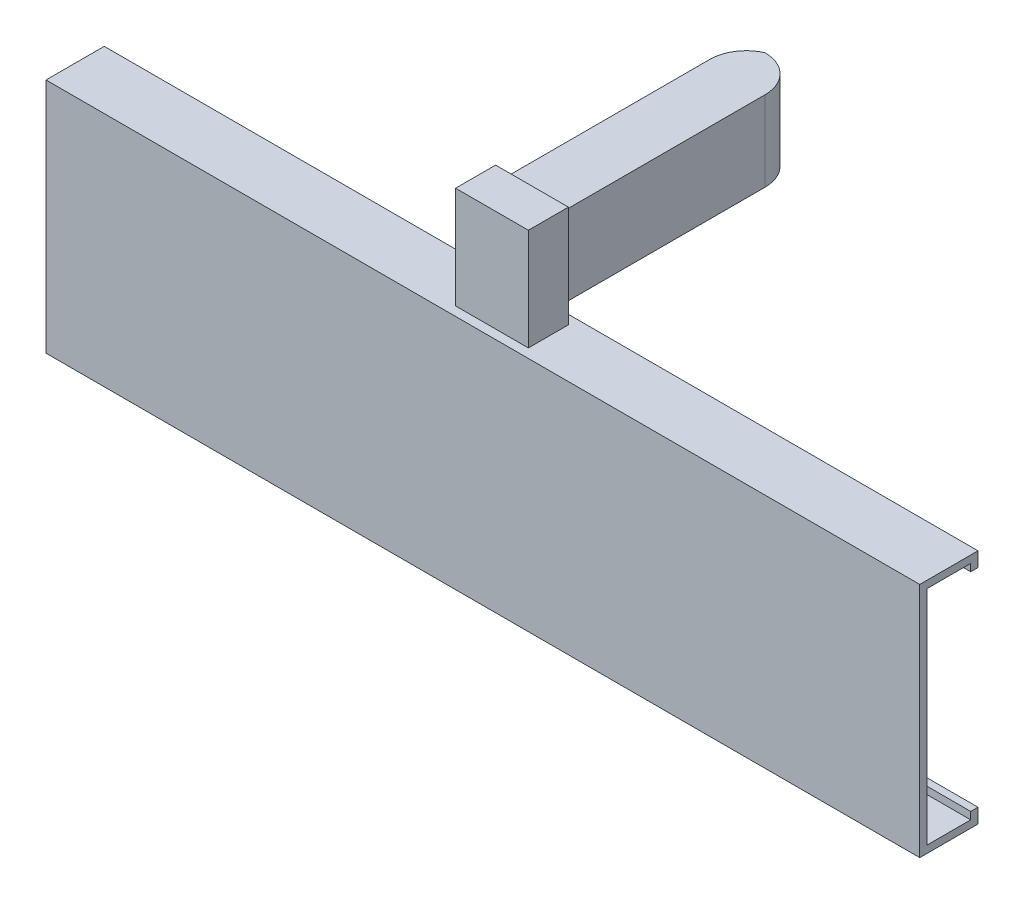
ISO-10303-21;
HEADER;
FILE_DESCRIPTION(('STEP AP214'),'2;1');
FILE_NAME('part.step','',(''),(''),'','','');
FILE_SCHEMA(('AUTOMOTIVE_DESIGN { 1 0 10303 214 1 1 1 1 }'));
ENDSEC;
DATA;
#1=APPLICATION_CONTEXT('core data for automotive mechanical design processes');
#2=APPLICATION_PROTOCOL_DEFINITION('international standard','automotive_design',2000,#1);
#3=PRODUCT_CONTEXT('',#1,'mechanical');
#4=PRODUCT('Part','Part','',(#3));
#5=PRODUCT_RELATED_PRODUCT_CATEGORY('part','',(#4));
#6=PRODUCT_DEFINITION_FORMATION('','',#4);
#7=PRODUCT_DEFINITION_CONTEXT('part definition',#1,'design');
#8=PRODUCT_DEFINITION('design','',#6,#7);
#9=PRODUCT_DEFINITION_SHAPE('','',#8);
#10=(LENGTH_UNIT() NAMED_UNIT(*) SI_UNIT(.MILLI.,.METRE.));
#11=(NAMED_UNIT(*) PLANE_ANGLE_UNIT() SI_UNIT($,.RADIAN.));
#12=(NAMED_UNIT(*) SI_UNIT($,.STERADIAN.) SOLID_ANGLE_UNIT());
#13=UNCERTAINTY_MEASURE_WITH_UNIT(LENGTH_MEASURE(1.E-05),#10,'distance_accuracy_value','');
#14=(GEOMETRIC_REPRESENTATION_CONTEXT(3) GLOBAL_UNCERTAINTY_ASSIGNED_CONTEXT((#13)) GLOBAL_UNIT_ASSIGNED_CONTEXT((#10,
#11,#12)) REPRESENTATION_CONTEXT('',''));
#15=CARTESIAN_POINT('',(0.,0.,0.));
#16=DIRECTION('',(0.,0.,1.));
#17=DIRECTION('',(1.,0.,0.));
#18=AXIS2_PLACEMENT_3D('',#15,#16,#17);
#19=CARTESIAN_POINT('',(-5.00108484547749,29.75,-5.75));
#20=DIRECTION('',(0.,0.,1.));
#21=DIRECTION('',(1.,0.,0.));
#22=AXIS2_PLACEMENT_3D('',#19,#20,#21);
#23=PLANE('',#22);
#24=DIRECTION('',(-1.,0.,0.));
#25=VECTOR('',#24,1.);
#26=CARTESIAN_POINT('',(-5.00108484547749,15.75,-5.75));
#27=LINE('',#26,#25);
#28=CARTESIAN_POINT('',(4.99891515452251,15.75,-5.75));
#29=VERTEX_POINT('',#28);
#30=CARTESIAN_POINT('',(-5.00108484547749,15.75,-5.75));
#31=VERTEX_POINT('',#30);
#32=EDGE_CURVE('E222',#29,#31,#27,.T.);
#33=ORIENTED_EDGE('',*,*,#32,.T.);
#34=DIRECTION('',(0.,-1.,0.));
#35=VECTOR('',#34,1.);
#36=CARTESIAN_POINT('',(-5.00108484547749,29.75,-5.75));
#37=LINE('',#36,#35);
#38=CARTESIAN_POINT('',(-5.00108484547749,29.75,-5.75));
#39=VERTEX_POINT('',#38);
#40=EDGE_CURVE('E235',#39,#31,#37,.T.);
#41=ORIENTED_EDGE('',*,*,#40,.F.);
#42=DIRECTION('',(-1.,0.,0.));
#43=VECTOR('',#42,1.);
#44=CARTESIAN_POINT('',(-5.00108484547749,29.75,-5.75));
#45=LINE('',#44,#43);
#46=CARTESIAN_POINT('',(4.99891515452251,29.75,-5.75));
#47=VERTEX_POINT('',#46);
#48=EDGE_CURVE('E212',#47,#39,#45,.T.);
#49=ORIENTED_EDGE('',*,*,#48,.F.);
#50=DIRECTION('',(0.,-1.,0.));
#51=VECTOR('',#50,1.);
#52=CARTESIAN_POINT('',(4.99891515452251,29.75,-5.75));
#53=LINE('',#52,#51);
#54=EDGE_CURVE('E238',#47,#29,#53,.T.);
#55=ORIENTED_EDGE('',*,*,#54,.T.);
#56=EDGE_LOOP('',(#33,#41,#49,#55));
#57=FACE_BOUND('',#56,.T.);
#58=DIRECTION('',(0.,1.,0.));
#59=VECTOR('',#58,1.);
#60=CARTESIAN_POINT('',(-4.00108484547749,17.6137453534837,-5.75));
#61=LINE('',#60,#59);
#62=CARTESIAN_POINT('',(-4.00108484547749,17.6137453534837,-5.75));
#63=VERTEX_POINT('',#62);
#64=CARTESIAN_POINT('',(-4.00108484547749,28.6137453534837,-5.75));
#65=VERTEX_POINT('',#64);
#66=EDGE_CURVE('E181',#63,#65,#61,.T.);
#67=ORIENTED_EDGE('',*,*,#66,.F.);
#68=DIRECTION('',(-1.,0.,0.));
#69=VECTOR('',#68,1.);
#70=CARTESIAN_POINT('',(3.99891515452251,17.6137453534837,-5.75));
#71=LINE('',#70,#69);
#72=CARTESIAN_POINT('',(3.99891515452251,17.6137453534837,-5.75));
#73=VERTEX_POINT('',#72);
#74=EDGE_CURVE('E186',#73,#63,#71,.T.);
#75=ORIENTED_EDGE('',*,*,#74,.F.);
#76=DIRECTION('',(0.,-1.,0.));
#77=VECTOR('',#76,1.);
#78=CARTESIAN_POINT('',(3.99891515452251,17.6137453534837,-5.75));
#79=LINE('',#78,#77);
#80=CARTESIAN_POINT('',(3.99891515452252,28.6137453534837,-5.75));
#81=VERTEX_POINT('',#80);
#82=EDGE_CURVE('E198',#81,#73,#79,.T.);
#83=ORIENTED_EDGE('',*,*,#82,.F.);
#84=DIRECTION('',(1.,0.,0.));
#85=VECTOR('',#84,1.);
#86=CARTESIAN_POINT('',(3.99891515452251,28.6137453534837,-5.75));
#87=LINE('',#86,#85);
#88=EDGE_CURVE('E194',#65,#81,#87,.T.);
#89=ORIENTED_EDGE('',*,*,#88,.F.);
#90=EDGE_LOOP('',(#67,#75,#83,#89));
#91=FACE_BOUND('',#90,.T.);
#92=ADVANCED_FACE('F39',(#57,#91),#23,.F.);
#93=CARTESIAN_POINT('',(-60.,15.75,1.));
#94=DIRECTION('',(0.,-1.,0.));
#95=DIRECTION('',(0.,0.,-1.));
#96=AXIS2_PLACEMENT_3D('',#93,#94,#95);
#97=PLANE('',#96);
#98=DIRECTION('',(0.,0.,-1.));
#99=VECTOR('',#98,1.);
#100=CARTESIAN_POINT('',(60.,15.75,1.));
#101=LINE('',#100,#99);
#102=CARTESIAN_POINT('',(60.,15.75,1.));
#103=VERTEX_POINT('',#102);
#104=CARTESIAN_POINT('',(60.,15.75,-7.));
#105=VERTEX_POINT('',#104);
#106=EDGE_CURVE('E330',#103,#105,#101,.T.);
#107=ORIENTED_EDGE('',*,*,#106,.T.);
#108=DIRECTION('',(-1.,0.,0.));
#109=VECTOR('',#108,1.);
#110=CARTESIAN_POINT('',(-60.,15.75,-7.));
#111=LINE('',#110,#109);
#112=CARTESIAN_POINT('',(-60.,15.75,-7.));
#113=VERTEX_POINT('',#112);
#114=EDGE_CURVE('E296',#105,#113,#111,.T.);
#115=ORIENTED_EDGE('',*,*,#114,.T.);
#116=DIRECTION('',(0.,0.,-1.));
#117=VECTOR('',#116,1.);
#118=CARTESIAN_POINT('',(-60.,15.75,1.));
#119=LINE('',#118,#117);
#120=CARTESIAN_POINT('',(-60.,15.75,1.));
#121=VERTEX_POINT('',#120);
#122=EDGE_CURVE('E322',#121,#113,#119,.T.);
#123=ORIENTED_EDGE('',*,*,#122,.F.);
#124=DIRECTION('',(-1.,0.,0.));
#125=VECTOR('',#124,1.);
#126=CARTESIAN_POINT('',(-60.,15.75,1.));
#127=LINE('',#126,#125);
#128=EDGE_CURVE('E317',#103,#121,#127,.T.);
#129=ORIENTED_EDGE('',*,*,#128,.F.);
#130=EDGE_LOOP('',(#107,#115,#123,#129));
#131=FACE_BOUND('',#130,.T.);
#132=DIRECTION('',(0.,0.,-1.));
#133=VECTOR('',#132,1.);
#134=CARTESIAN_POINT('',(4.99891515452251,15.75,-5.75));
#135=LINE('',#134,#133);
#136=CARTESIAN_POINT('',(4.99891515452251,15.75,-0.250000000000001));
#137=VERTEX_POINT('',#136);
#138=EDGE_CURVE('E208',#137,#29,#135,.T.);
#139=ORIENTED_EDGE('',*,*,#138,.F.);
#140=DIRECTION('',(1.,0.,0.));
#141=VECTOR('',#140,1.);
#142=CARTESIAN_POINT('',(-5.00108484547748,15.75,-0.250000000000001));
#143=LINE('',#142,#141);
#144=CARTESIAN_POINT('',(-5.00108484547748,15.75,-0.250000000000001));
#145=VERTEX_POINT('',#144);
#146=EDGE_CURVE('E213',#145,#137,#143,.T.);
#147=ORIENTED_EDGE('',*,*,#146,.F.);
#148=DIRECTION('',(0.,0.,1.));
#149=VECTOR('',#148,1.);
#150=CARTESIAN_POINT('',(-5.00108484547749,15.75,-5.75));
#151=LINE('',#150,#149);
#152=EDGE_CURVE('E225',#31,#145,#151,.T.);
#153=ORIENTED_EDGE('',*,*,#152,.F.);
#154=ORIENTED_EDGE('',*,*,#32,.F.);
#155=EDGE_LOOP('',(#139,#147,#153,#154));
#156=FACE_BOUND('',#155,.T.);
#157=ADVANCED_FACE('F362',(#131,#156),#97,.F.);
#158=CARTESIAN_POINT('',(0.,-15.75,0.));
#159=DIRECTION('',(0.,-1.,0.));
#160=DIRECTION('',(0.,0.,-1.));
#161=AXIS2_PLACEMENT_3D('',#158,#159,#160);
#162=PLANE('',#161);
#163=DIRECTION('',(1.,0.,0.));
#164=VECTOR('',#163,1.);
#165=CARTESIAN_POINT('',(-60.,-15.75,-6.));
#166=LINE('',#165,#164);
#167=CARTESIAN_POINT('',(-60.,-15.75,-6.));
#168=VERTEX_POINT('',#167);
#169=CARTESIAN_POINT('',(60.,-15.75,-6.));
#170=VERTEX_POINT('',#169);
#171=EDGE_CURVE('E241',#168,#170,#166,.T.);
#172=ORIENTED_EDGE('',*,*,#171,.F.);
#173=DIRECTION('',(0.,0.,-1.));
#174=VECTOR('',#173,1.);
#175=CARTESIAN_POINT('',(-60.,-15.75,1.));
#176=LINE('',#175,#174);
#177=CARTESIAN_POINT('',(-60.,-15.75,0.));
#178=VERTEX_POINT('',#177);
#179=EDGE_CURVE('E259',#178,#168,#176,.T.);
#180=ORIENTED_EDGE('',*,*,#179,.F.);
#181=DIRECTION('',(1.,0.,0.));
#182=VECTOR('',#181,1.);
#183=CARTESIAN_POINT('',(-60.,-15.75,0.));
#184=LINE('',#183,#182);
#185=CARTESIAN_POINT('',(60.,-15.75,0.));
#186=VERTEX_POINT('',#185);
#187=EDGE_CURVE('E318',#178,#186,#184,.T.);
#188=ORIENTED_EDGE('',*,*,#187,.T.);
#189=DIRECTION('',(0.,0.,1.));
#190=VECTOR('',#189,1.);
#191=CARTESIAN_POINT('',(60.,-15.75,1.));
#192=LINE('',#191,#190);
#193=EDGE_CURVE('E264',#170,#186,#192,.T.);
#194=ORIENTED_EDGE('',*,*,#193,.F.);
#195=EDGE_LOOP('',(#172,#180,#188,#194));
#196=FACE_BOUND('',#195,.T.);
#197=ADVANCED_FACE('F369',(#196),#162,.F.);
#198=CARTESIAN_POINT('',(0.,14.75,0.));
#199=DIRECTION('',(0.,-1.,0.));
#200=DIRECTION('',(0.,0.,-1.));
#201=AXIS2_PLACEMENT_3D('',#198,#199,#200);
#202=PLANE('',#201);
#203=DIRECTION('',(0.,0.,1.));
#204=VECTOR('',#203,1.);
#205=CARTESIAN_POINT('',(-60.,14.75,0.));
#206=LINE('',#205,#204);
#207=CARTESIAN_POINT('',(-60.,14.75,-6.));
#208=VERTEX_POINT('',#207);
#209=CARTESIAN_POINT('',(-60.,14.75,0.));
#210=VERTEX_POINT('',#209);
#211=EDGE_CURVE('E297',#208,#210,#206,.T.);
#212=ORIENTED_EDGE('',*,*,#211,.F.);
#213=DIRECTION('',(-1.,0.,0.));
#214=VECTOR('',#213,1.);
#215=CARTESIAN_POINT('',(-60.,14.75,-6.));
#216=LINE('',#215,#214);
#217=CARTESIAN_POINT('',(60.,14.75,-6.));
#218=VERTEX_POINT('',#217);
#219=EDGE_CURVE('E279',#218,#208,#216,.T.);
#220=ORIENTED_EDGE('',*,*,#219,.F.);
#221=DIRECTION('',(0.,0.,-1.));
#222=VECTOR('',#221,1.);
#223=CARTESIAN_POINT('',(60.,14.75,0.));
#224=LINE('',#223,#222);
#225=CARTESIAN_POINT('',(60.,14.75,0.));
#226=VERTEX_POINT('',#225);
#227=EDGE_CURVE('E302',#226,#218,#224,.T.);
#228=ORIENTED_EDGE('',*,*,#227,.F.);
#229=DIRECTION('',(1.,0.,0.));
#230=VECTOR('',#229,1.);
#231=CARTESIAN_POINT('',(-60.,14.75,0.));
#232=LINE('',#231,#230);
#233=EDGE_CURVE('E299',#210,#226,#232,.T.);
#234=ORIENTED_EDGE('',*,*,#233,.F.);
#235=EDGE_LOOP('',(#212,#220,#228,#234));
#236=FACE_BOUND('',#235,.T.);
#237=ADVANCED_FACE('F395',(#236),#202,.T.);
#238=CARTESIAN_POINT('',(0.,0.,0.));
#239=DIRECTION('',(0.,0.,-1.));
#240=DIRECTION('',(-1.,0.,0.));
#241=AXIS2_PLACEMENT_3D('',#238,#239,#240);
#242=PLANE('',#241);
#243=DIRECTION('',(0.,-1.,0.));
#244=VECTOR('',#243,1.);
#245=CARTESIAN_POINT('',(-60.,-15.75,0.));
#246=LINE('',#245,#244);
#247=EDGE_CURVE('E325',#210,#178,#246,.T.);
#248=ORIENTED_EDGE('',*,*,#247,.F.);
#249=ORIENTED_EDGE('',*,*,#233,.T.);
#250=DIRECTION('',(0.,1.,0.));
#251=VECTOR('',#250,1.);
#252=CARTESIAN_POINT('',(60.,-15.75,0.));
#253=LINE('',#252,#251);
#254=EDGE_CURVE('E311',#186,#226,#253,.T.);
#255=ORIENTED_EDGE('',*,*,#254,.F.);
#256=ORIENTED_EDGE('',*,*,#187,.F.);
#257=EDGE_LOOP('',(#248,#249,#255,#256));
#258=FACE_BOUND('',#257,.T.);
#259=ADVANCED_FACE('F411',(#258),#242,.T.);
#260=CARTESIAN_POINT('',(60.,-15.75,1.));
#261=DIRECTION('',(-1.,0.,0.));
#262=DIRECTION('',(0.,0.,1.));
#263=AXIS2_PLACEMENT_3D('',#260,#261,#262);
#264=PLANE('',#263);
#265=ORIENTED_EDGE('',*,*,#254,.T.);
#266=ORIENTED_EDGE('',*,*,#227,.T.);
#267=DIRECTION('',(0.,1.,0.));
#268=VECTOR('',#267,1.);
#269=CARTESIAN_POINT('',(60.,13.75,-6.));
#270=LINE('',#269,#268);
#271=CARTESIAN_POINT('',(60.,13.75,-6.));
#272=VERTEX_POINT('',#271);
#273=EDGE_CURVE('E294',#272,#218,#270,.T.);
#274=ORIENTED_EDGE('',*,*,#273,.F.);
#275=DIRECTION('',(0.,0.,1.));
#276=VECTOR('',#275,1.);
#277=CARTESIAN_POINT('',(60.,13.75,-7.));
#278=LINE('',#277,#276);
#279=CARTESIAN_POINT('',(60.,13.75,-7.));
#280=VERTEX_POINT('',#279);
#281=EDGE_CURVE('E286',#280,#272,#278,.T.);
#282=ORIENTED_EDGE('',*,*,#281,.F.);
#283=DIRECTION('',(0.,1.,0.));
#284=VECTOR('',#283,1.);
#285=CARTESIAN_POINT('',(60.,14.75,-7.));
#286=LINE('',#285,#284);
#287=EDGE_CURVE('E305',#280,#105,#286,.T.);
#288=ORIENTED_EDGE('',*,*,#287,.T.);
#289=ORIENTED_EDGE('',*,*,#106,.F.);
#290=DIRECTION('',(0.,1.,0.));
#291=VECTOR('',#290,1.);
#292=CARTESIAN_POINT('',(60.,-15.75,1.));
#293=LINE('',#292,#291);
#294=CARTESIAN_POINT('',(60.,-16.75,1.));
#295=VERTEX_POINT('',#294);
#296=EDGE_CURVE('E314',#295,#103,#293,.T.);
#297=ORIENTED_EDGE('',*,*,#296,.F.);
#298=DIRECTION('',(0.,0.,1.));
#299=VECTOR('',#298,1.);
#300=CARTESIAN_POINT('',(60.,-16.75,1.));
#301=LINE('',#300,#299);
#302=CARTESIAN_POINT('',(60.,-16.75,-7.));
#303=VERTEX_POINT('',#302);
#304=EDGE_CURVE('E266',#303,#295,#301,.T.);
#305=ORIENTED_EDGE('',*,*,#304,.F.);
#306=DIRECTION('',(0.,1.,0.));
#307=VECTOR('',#306,1.);
#308=CARTESIAN_POINT('',(60.,-16.75,-7.));
#309=LINE('',#308,#307);
#310=CARTESIAN_POINT('',(60.,-14.75,-7.));
#311=VERTEX_POINT('',#310);
#312=EDGE_CURVE('E272',#303,#311,#309,.T.);
#313=ORIENTED_EDGE('',*,*,#312,.T.);
#314=DIRECTION('',(0.,0.,-1.));
#315=VECTOR('',#314,1.);
#316=CARTESIAN_POINT('',(60.,-14.75,-7.));
#317=LINE('',#316,#315);
#318=CARTESIAN_POINT('',(60.,-14.75,-6.));
#319=VERTEX_POINT('',#318);
#320=EDGE_CURVE('E247',#319,#311,#317,.T.);
#321=ORIENTED_EDGE('',*,*,#320,.F.);
#322=DIRECTION('',(0.,-1.,0.));
#323=VECTOR('',#322,1.);
#324=CARTESIAN_POINT('',(60.,-14.75,-6.));
#325=LINE('',#324,#323);
#326=EDGE_CURVE('E253',#319,#170,#325,.T.);
#327=ORIENTED_EDGE('',*,*,#326,.T.);
#328=ORIENTED_EDGE('',*,*,#193,.T.);
#329=EDGE_LOOP('',(#265,#266,#274,#282,#288,#289,#297,#305,#313,#321,#327,#328));
#330=FACE_BOUND('',#329,.T.);
#331=ADVANCED_FACE('F423',(#330),#264,.F.);
#332=CARTESIAN_POINT('',(-60.,-15.75,1.));
#333=DIRECTION('',(1.,0.,0.));
#334=DIRECTION('',(0.,0.,-1.));
#335=AXIS2_PLACEMENT_3D('',#332,#333,#334);
#336=PLANE('',#335);
#337=ORIENTED_EDGE('',*,*,#122,.T.);
#338=DIRECTION('',(0.,1.,0.));
#339=VECTOR('',#338,1.);
#340=CARTESIAN_POINT('',(-60.,14.75,-7.));
#341=LINE('',#340,#339);
#342=CARTESIAN_POINT('',(-60.,13.75,-7.));
#343=VERTEX_POINT('',#342);
#344=EDGE_CURVE('E308',#343,#113,#341,.T.);
#345=ORIENTED_EDGE('',*,*,#344,.F.);
#346=DIRECTION('',(0.,0.,-1.));
#347=VECTOR('',#346,1.);
#348=CARTESIAN_POINT('',(-60.,13.75,-7.));
#349=LINE('',#348,#347);
#350=CARTESIAN_POINT('',(-60.,13.75,-6.));
#351=VERTEX_POINT('',#350);
#352=EDGE_CURVE('E280',#351,#343,#349,.T.);
#353=ORIENTED_EDGE('',*,*,#352,.F.);
#354=DIRECTION('',(0.,1.,0.));
#355=VECTOR('',#354,1.);
#356=CARTESIAN_POINT('',(-60.,13.75,-6.));
#357=LINE('',#356,#355);
#358=EDGE_CURVE('E290',#351,#208,#357,.T.);
#359=ORIENTED_EDGE('',*,*,#358,.T.);
#360=ORIENTED_EDGE('',*,*,#211,.T.);
#361=ORIENTED_EDGE('',*,*,#247,.T.);
#362=ORIENTED_EDGE('',*,*,#179,.T.);
#363=DIRECTION('',(0.,-1.,0.));
#364=VECTOR('',#363,1.);
#365=CARTESIAN_POINT('',(-60.,-14.75,-6.));
#366=LINE('',#365,#364);
#367=CARTESIAN_POINT('',(-60.,-14.75,-6.));
#368=VERTEX_POINT('',#367);
#369=EDGE_CURVE('E257',#368,#168,#366,.T.);
#370=ORIENTED_EDGE('',*,*,#369,.F.);
#371=DIRECTION('',(0.,0.,1.));
#372=VECTOR('',#371,1.);
#373=CARTESIAN_POINT('',(-60.,-14.75,-7.));
#374=LINE('',#373,#372);
#375=CARTESIAN_POINT('',(-60.,-14.75,-7.));
#376=VERTEX_POINT('',#375);
#377=EDGE_CURVE('E242',#376,#368,#374,.T.);
#378=ORIENTED_EDGE('',*,*,#377,.F.);
#379=DIRECTION('',(0.,1.,0.));
#380=VECTOR('',#379,1.);
#381=CARTESIAN_POINT('',(-60.,-16.75,-7.));
#382=LINE('',#381,#380);
#383=CARTESIAN_POINT('',(-60.,-16.75,-7.));
#384=VERTEX_POINT('',#383);
#385=EDGE_CURVE('E277',#384,#376,#382,.T.);
#386=ORIENTED_EDGE('',*,*,#385,.F.);
#387=DIRECTION('',(0.,0.,-1.));
#388=VECTOR('',#387,1.);
#389=CARTESIAN_POINT('',(-60.,-16.75,1.));
#390=LINE('',#389,#388);
#391=CARTESIAN_POINT('',(-60.,-16.75,1.));
#392=VERTEX_POINT('',#391);
#393=EDGE_CURVE('E260',#392,#384,#390,.T.);
#394=ORIENTED_EDGE('',*,*,#393,.F.);
#395=DIRECTION('',(0.,-1.,0.));
#396=VECTOR('',#395,1.);
#397=CARTESIAN_POINT('',(-60.,-15.75,1.));
#398=LINE('',#397,#396);
#399=EDGE_CURVE('E320',#121,#392,#398,.T.);
#400=ORIENTED_EDGE('',*,*,#399,.F.);
#401=EDGE_LOOP('',(#337,#345,#353,#359,#360,#361,#362,#370,#378,#386,#394,#400));
#402=FACE_BOUND('',#401,.T.);
#403=ADVANCED_FACE('F419',(#402),#336,.F.);
#404=CARTESIAN_POINT('',(0.,0.,1.));
#405=DIRECTION('',(0.,0.,-1.));
#406=DIRECTION('',(-1.,0.,0.));
#407=AXIS2_PLACEMENT_3D('',#404,#405,#406);
#408=PLANE('',#407);
#409=ORIENTED_EDGE('',*,*,#296,.T.);
#410=ORIENTED_EDGE('',*,*,#128,.T.);
#411=ORIENTED_EDGE('',*,*,#399,.T.);
#412=DIRECTION('',(-1.,0.,0.));
#413=VECTOR('',#412,1.);
#414=CARTESIAN_POINT('',(-60.,-16.75,1.));
#415=LINE('',#414,#413);
#416=EDGE_CURVE('E269',#295,#392,#415,.T.);
#417=ORIENTED_EDGE('',*,*,#416,.F.);
#418=EDGE_LOOP('',(#409,#410,#411,#417));
#419=FACE_BOUND('',#418,.T.);
#420=ADVANCED_FACE('F415',(#419),#408,.F.);
#421=CARTESIAN_POINT('',(-60.,14.75,-7.));
#422=DIRECTION('',(0.,0.,-1.));
#423=DIRECTION('',(-1.,0.,0.));
#424=AXIS2_PLACEMENT_3D('',#421,#422,#423);
#425=PLANE('',#424);
#426=ORIENTED_EDGE('',*,*,#114,.F.);
#427=ORIENTED_EDGE('',*,*,#287,.F.);
#428=DIRECTION('',(1.,0.,0.));
#429=VECTOR('',#428,1.);
#430=CARTESIAN_POINT('',(-60.,13.75,-7.));
#431=LINE('',#430,#429);
#432=EDGE_CURVE('E283',#343,#280,#431,.T.);
#433=ORIENTED_EDGE('',*,*,#432,.F.);
#434=ORIENTED_EDGE('',*,*,#344,.T.);
#435=EDGE_LOOP('',(#426,#427,#433,#434));
#436=FACE_BOUND('',#435,.T.);
#437=ADVANCED_FACE('F407',(#436),#425,.T.);
#438=CARTESIAN_POINT('',(-60.,13.75,-6.));
#439=DIRECTION('',(0.,0.,-1.));
#440=DIRECTION('',(-1.,0.,0.));
#441=AXIS2_PLACEMENT_3D('',#438,#439,#440);
#442=PLANE('',#441);
#443=ORIENTED_EDGE('',*,*,#219,.T.);
#444=ORIENTED_EDGE('',*,*,#358,.F.);
#445=DIRECTION('',(-1.,0.,0.));
#446=VECTOR('',#445,1.);
#447=CARTESIAN_POINT('',(-60.,13.75,-6.));
#448=LINE('',#447,#446);
#449=EDGE_CURVE('E288',#272,#351,#448,.T.);
#450=ORIENTED_EDGE('',*,*,#449,.F.);
#451=ORIENTED_EDGE('',*,*,#273,.T.);
#452=EDGE_LOOP('',(#443,#444,#450,#451));
#453=FACE_BOUND('',#452,.T.);
#454=ADVANCED_FACE('F403',(#453),#442,.F.);
#455=CARTESIAN_POINT('',(0.,13.75,0.));
#456=DIRECTION('',(0.,1.,0.));
#457=DIRECTION('',(0.,0.,1.));
#458=AXIS2_PLACEMENT_3D('',#455,#456,#457);
#459=PLANE('',#458);
#460=ORIENTED_EDGE('',*,*,#352,.T.);
#461=ORIENTED_EDGE('',*,*,#432,.T.);
#462=ORIENTED_EDGE('',*,*,#281,.T.);
#463=ORIENTED_EDGE('',*,*,#449,.T.);
#464=EDGE_LOOP('',(#460,#461,#462,#463));
#465=FACE_BOUND('',#464,.T.);
#466=ADVANCED_FACE('F399',(#465),#459,.F.);
#467=CARTESIAN_POINT('',(-60.,-16.75,-7.));
#468=DIRECTION('',(0.,0.,1.));
#469=DIRECTION('',(1.,0.,0.));
#470=AXIS2_PLACEMENT_3D('',#467,#468,#469);
#471=PLANE('',#470);
#472=ORIENTED_EDGE('',*,*,#385,.T.);
#473=DIRECTION('',(-1.,0.,0.));
#474=VECTOR('',#473,1.);
#475=CARTESIAN_POINT('',(-60.,-14.75,-7.));
#476=LINE('',#475,#474);
#477=EDGE_CURVE('E250',#311,#376,#476,.T.);
#478=ORIENTED_EDGE('',*,*,#477,.F.);
#479=ORIENTED_EDGE('',*,*,#312,.F.);
#480=DIRECTION('',(1.,0.,0.));
#481=VECTOR('',#480,1.);
#482=CARTESIAN_POINT('',(-60.,-16.75,-7.));
#483=LINE('',#482,#481);
#484=EDGE_CURVE('E263',#384,#303,#483,.T.);
#485=ORIENTED_EDGE('',*,*,#484,.F.);
#486=EDGE_LOOP('',(#472,#478,#479,#485));
#487=FACE_BOUND('',#486,.T.);
#488=ADVANCED_FACE('F391',(#487),#471,.F.);
#489=CARTESIAN_POINT('',(0.,-16.75,0.));
#490=DIRECTION('',(0.,-1.,0.));
#491=DIRECTION('',(0.,0.,-1.));
#492=AXIS2_PLACEMENT_3D('',#489,#490,#491);
#493=PLANE('',#492);
#494=ORIENTED_EDGE('',*,*,#393,.T.);
#495=ORIENTED_EDGE('',*,*,#484,.T.);
#496=ORIENTED_EDGE('',*,*,#304,.T.);
#497=ORIENTED_EDGE('',*,*,#416,.T.);
#498=EDGE_LOOP('',(#494,#495,#496,#497));
#499=FACE_BOUND('',#498,.T.);
#500=ADVANCED_FACE('F387',(#499),#493,.T.);
#501=CARTESIAN_POINT('',(-60.,-14.75,-6.));
#502=DIRECTION('',(0.,0.,-1.));
#503=DIRECTION('',(-1.,0.,0.));
#504=AXIS2_PLACEMENT_3D('',#501,#502,#503);
#505=PLANE('',#504);
#506=ORIENTED_EDGE('',*,*,#171,.T.);
#507=ORIENTED_EDGE('',*,*,#326,.F.);
#508=DIRECTION('',(1.,0.,0.));
#509=VECTOR('',#508,1.);
#510=CARTESIAN_POINT('',(-60.,-14.75,-6.));
#511=LINE('',#510,#509);
#512=EDGE_CURVE('E245',#368,#319,#511,.T.);
#513=ORIENTED_EDGE('',*,*,#512,.F.);
#514=ORIENTED_EDGE('',*,*,#369,.T.);
#515=EDGE_LOOP('',(#506,#507,#513,#514));
#516=FACE_BOUND('',#515,.T.);
#517=ADVANCED_FACE('F383',(#516),#505,.F.);
#518=CARTESIAN_POINT('',(0.,-14.75,0.));
#519=DIRECTION('',(0.,1.,0.));
#520=DIRECTION('',(0.,0.,1.));
#521=AXIS2_PLACEMENT_3D('',#518,#519,#520);
#522=PLANE('',#521);
#523=ORIENTED_EDGE('',*,*,#377,.T.);
#524=ORIENTED_EDGE('',*,*,#512,.T.);
#525=ORIENTED_EDGE('',*,*,#320,.T.);
#526=ORIENTED_EDGE('',*,*,#477,.T.);
#527=EDGE_LOOP('',(#523,#524,#525,#526));
#528=FACE_BOUND('',#527,.T.);
#529=ADVANCED_FACE('F379',(#528),#522,.T.);
#530=CARTESIAN_POINT('',(4.99891515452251,29.75,-5.75));
#531=DIRECTION('',(-1.,0.,0.));
#532=DIRECTION('',(0.,0.,1.));
#533=AXIS2_PLACEMENT_3D('',#530,#531,#532);
#534=PLANE('',#533);
#535=ORIENTED_EDGE('',*,*,#138,.T.);
#536=ORIENTED_EDGE('',*,*,#54,.F.);
#537=DIRECTION('',(0.,0.,-1.));
#538=VECTOR('',#537,1.);
#539=CARTESIAN_POINT('',(4.99891515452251,29.75,-5.75));
#540=LINE('',#539,#538);
#541=CARTESIAN_POINT('',(4.99891515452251,29.75,-0.250000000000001));
#542=VERTEX_POINT('',#541);
#543=EDGE_CURVE('E209',#542,#47,#540,.T.);
#544=ORIENTED_EDGE('',*,*,#543,.F.);
#545=DIRECTION('',(0.,-1.,0.));
#546=VECTOR('',#545,1.);
#547=CARTESIAN_POINT('',(4.99891515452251,29.75,-0.250000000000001));
#548=LINE('',#547,#546);
#549=EDGE_CURVE('E219',#542,#137,#548,.T.);
#550=ORIENTED_EDGE('',*,*,#549,.T.);
#551=EDGE_LOOP('',(#535,#536,#544,#550));
#552=FACE_BOUND('',#551,.T.);
#553=ADVANCED_FACE('F376',(#552),#534,.F.);
#554=CARTESIAN_POINT('',(-5.00108484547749,29.75,-5.75));
#555=DIRECTION('',(1.,0.,0.));
#556=DIRECTION('',(0.,0.,-1.));
#557=AXIS2_PLACEMENT_3D('',#554,#555,#556);
#558=PLANE('',#557);
#559=ORIENTED_EDGE('',*,*,#152,.T.);
#560=DIRECTION('',(0.,-1.,0.));
#561=VECTOR('',#560,1.);
#562=CARTESIAN_POINT('',(-5.00108484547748,29.75,-0.250000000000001));
#563=LINE('',#562,#561);
#564=CARTESIAN_POINT('',(-5.00108484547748,29.75,-0.250000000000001));
#565=VERTEX_POINT('',#564);
#566=EDGE_CURVE('E232',#565,#145,#563,.T.);
#567=ORIENTED_EDGE('',*,*,#566,.F.);
#568=DIRECTION('',(0.,0.,1.));
#569=VECTOR('',#568,1.);
#570=CARTESIAN_POINT('',(-5.00108484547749,29.75,-5.75));
#571=LINE('',#570,#569);
#572=EDGE_CURVE('E215',#39,#565,#571,.T.);
#573=ORIENTED_EDGE('',*,*,#572,.F.);
#574=ORIENTED_EDGE('',*,*,#40,.T.);
#575=EDGE_LOOP('',(#559,#567,#573,#574));
#576=FACE_BOUND('',#575,.T.);
#577=ADVANCED_FACE('F374',(#576),#558,.F.);
#578=CARTESIAN_POINT('',(-5.00108484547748,29.75,-0.250000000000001));
#579=DIRECTION('',(0.,0.,-1.));
#580=DIRECTION('',(-1.,0.,0.));
#581=AXIS2_PLACEMENT_3D('',#578,#579,#580);
#582=PLANE('',#581);
#583=ORIENTED_EDGE('',*,*,#146,.T.);
#584=ORIENTED_EDGE('',*,*,#549,.F.);
#585=DIRECTION('',(1.,0.,0.));
#586=VECTOR('',#585,1.);
#587=CARTESIAN_POINT('',(-5.00108484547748,29.75,-0.250000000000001));
#588=LINE('',#587,#586);
#589=EDGE_CURVE('E217',#565,#542,#588,.T.);
#590=ORIENTED_EDGE('',*,*,#589,.F.);
#591=ORIENTED_EDGE('',*,*,#566,.T.);
#592=EDGE_LOOP('',(#583,#584,#590,#591));
#593=FACE_BOUND('',#592,.T.);
#594=ADVANCED_FACE('F477',(#593),#582,.F.);
#595=CARTESIAN_POINT('',(0.,29.75,0.));
#596=DIRECTION('',(0.,1.,0.));
#597=DIRECTION('',(0.,0.,1.));
#598=AXIS2_PLACEMENT_3D('',#595,#596,#597);
#599=PLANE('',#598);
#600=ORIENTED_EDGE('',*,*,#543,.T.);
#601=ORIENTED_EDGE('',*,*,#48,.T.);
#602=ORIENTED_EDGE('',*,*,#572,.T.);
#603=ORIENTED_EDGE('',*,*,#589,.T.);
#604=EDGE_LOOP('',(#600,#601,#602,#603));
#605=FACE_BOUND('',#604,.T.);
#606=ADVANCED_FACE('F465',(#605),#599,.T.);
#607=CARTESIAN_POINT('',(-4.00108484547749,17.6137453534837,-38.75));
#608=DIRECTION('',(1.,0.,0.));
#609=DIRECTION('',(0.,0.,-1.));
#610=AXIS2_PLACEMENT_3D('',#607,#608,#609);
#611=PLANE('',#610);
#612=DIRECTION('',(0.,0.,1.));
#613=VECTOR('',#612,1.);
#614=CARTESIAN_POINT('',(-4.00108484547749,28.6137453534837,-38.75));
#615=LINE('',#614,#613);
#616=CARTESIAN_POINT('',(-4.00108484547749,28.6137453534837,-34.1674243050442));
#617=VERTEX_POINT('',#616);
#618=EDGE_CURVE('E206',#617,#65,#615,.T.);
#619=ORIENTED_EDGE('',*,*,#618,.F.);
#620=DIRECTION('',(0.,-1.,0.));
#621=VECTOR('',#620,1.);
#622=CARTESIAN_POINT('',(-4.00108484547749,17.6137453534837,-34.1674243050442));
#623=LINE('',#622,#621);
#624=CARTESIAN_POINT('',(-4.00108484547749,17.6137453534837,-34.1674243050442));
#625=VERTEX_POINT('',#624);
#626=EDGE_CURVE('E47',#617,#625,#623,.T.);
#627=ORIENTED_EDGE('',*,*,#626,.T.);
#628=DIRECTION('',(0.,0.,1.));
#629=VECTOR('',#628,1.);
#630=CARTESIAN_POINT('',(-4.00108484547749,17.6137453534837,-38.75));
#631=LINE('',#630,#629);
#632=EDGE_CURVE('E178',#625,#63,#631,.T.);
#633=ORIENTED_EDGE('',*,*,#632,.T.);
#634=ORIENTED_EDGE('',*,*,#66,.T.);
#635=EDGE_LOOP('',(#619,#627,#633,#634));
#636=FACE_BOUND('',#635,.T.);
#637=ADVANCED_FACE('F180',(#636),#611,.F.);
#638=CARTESIAN_POINT('',(3.99891515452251,28.6137453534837,-38.75));
#639=DIRECTION('',(0.,-1.,0.));
#640=DIRECTION('',(0.,0.,-1.));
#641=AXIS2_PLACEMENT_3D('',#638,#639,#640);
#642=PLANE('',#641);
#643=CARTESIAN_POINT('',(-1.00108484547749,28.6137453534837,-33.75));
#644=DIRECTION('',(0.,-1.,0.));
#645=DIRECTION('',(0.,0.,-1.));
#646=AXIS2_PLACEMENT_3D('',#643,#644,#645);
#647=CIRCLE('',#646,5.);
#648=CARTESIAN_POINT('',(3.99891515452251,28.6137453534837,-33.75));
#649=VERTEX_POINT('',#648);
#650=CARTESIAN_POINT('',(-1.00108484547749,28.6137453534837,-38.75));
#651=VERTEX_POINT('',#650);
#652=EDGE_CURVE('E339',#649,#651,#647,.F.);
#653=ORIENTED_EDGE('',*,*,#652,.T.);
#654=CARTESIAN_POINT('',(0.998915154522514,28.6137453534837,-34.1674243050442));
#655=DIRECTION('',(0.,-1.,0.));
#656=DIRECTION('',(0.,0.,-1.));
#657=AXIS2_PLACEMENT_3D('',#654,#655,#656);
#658=CIRCLE('',#657,5.);
#659=EDGE_CURVE('E61',#651,#617,#658,.F.);
#660=ORIENTED_EDGE('',*,*,#659,.T.);
#661=ORIENTED_EDGE('',*,*,#618,.T.);
#662=ORIENTED_EDGE('',*,*,#88,.T.);
#663=DIRECTION('',(0.,0.,1.));
#664=VECTOR('',#663,1.);
#665=CARTESIAN_POINT('',(3.99891515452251,28.6137453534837,-38.75));
#666=LINE('',#665,#664);
#667=EDGE_CURVE('E204',#649,#81,#666,.T.);
#668=ORIENTED_EDGE('',*,*,#667,.F.);
#669=EDGE_LOOP('',(#653,#660,#661,#662,#668));
#670=FACE_BOUND('',#669,.T.);
#671=ADVANCED_FACE('F344',(#670),#642,.F.);
#672=CARTESIAN_POINT('',(3.99891515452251,17.6137453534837,-38.75));
#673=DIRECTION('',(-1.,0.,0.));
#674=DIRECTION('',(0.,0.,1.));
#675=AXIS2_PLACEMENT_3D('',#672,#673,#674);
#676=PLANE('',#675);
#677=DIRECTION('',(0.,0.,1.));
#678=VECTOR('',#677,1.);
#679=CARTESIAN_POINT('',(3.99891515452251,17.6137453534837,-38.75));
#680=LINE('',#679,#678);
#681=CARTESIAN_POINT('',(3.99891515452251,17.6137453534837,-33.75));
#682=VERTEX_POINT('',#681);
#683=EDGE_CURVE('E185',#682,#73,#680,.T.);
#684=ORIENTED_EDGE('',*,*,#683,.F.);
#685=DIRECTION('',(0.,-1.,0.));
#686=VECTOR('',#685,1.);
#687=CARTESIAN_POINT('',(3.99891515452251,17.6137453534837,-33.75));
#688=LINE('',#687,#686);
#689=EDGE_CURVE('E337',#682,#649,#688,.F.);
#690=ORIENTED_EDGE('',*,*,#689,.T.);
#691=ORIENTED_EDGE('',*,*,#667,.T.);
#692=ORIENTED_EDGE('',*,*,#82,.T.);
#693=EDGE_LOOP('',(#684,#690,#691,#692));
#694=FACE_BOUND('',#693,.T.);
#695=ADVANCED_FACE('F351',(#694),#676,.F.);
#696=CARTESIAN_POINT('',(3.99891515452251,17.6137453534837,-38.75));
#697=DIRECTION('',(0.,1.,0.));
#698=DIRECTION('',(0.,0.,1.));
#699=AXIS2_PLACEMENT_3D('',#696,#697,#698);
#700=PLANE('',#699);
#701=ORIENTED_EDGE('',*,*,#632,.F.);
#702=CARTESIAN_POINT('',(0.998915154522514,17.6137453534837,-34.1674243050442));
#703=DIRECTION('',(0.,1.,0.));
#704=DIRECTION('',(0.,0.,1.));
#705=AXIS2_PLACEMENT_3D('',#702,#703,#704);
#706=CIRCLE('',#705,5.);
#707=CARTESIAN_POINT('',(-1.00108484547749,17.6137453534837,-38.75));
#708=VERTEX_POINT('',#707);
#709=EDGE_CURVE('E11',#625,#708,#706,.F.);
#710=ORIENTED_EDGE('',*,*,#709,.T.);
#711=CARTESIAN_POINT('',(-1.00108484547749,17.6137453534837,-33.75));
#712=DIRECTION('',(0.,1.,0.));
#713=DIRECTION('',(0.,0.,1.));
#714=AXIS2_PLACEMENT_3D('',#711,#712,#713);
#715=CIRCLE('',#714,5.);
#716=EDGE_CURVE('E335',#708,#682,#715,.F.);
#717=ORIENTED_EDGE('',*,*,#716,.T.);
#718=ORIENTED_EDGE('',*,*,#683,.T.);
#719=ORIENTED_EDGE('',*,*,#74,.T.);
#720=EDGE_LOOP('',(#701,#710,#717,#718,#719));
#721=FACE_BOUND('',#720,.T.);
#722=ADVANCED_FACE('F196',(#721),#700,.F.);
#723=CARTESIAN_POINT('',(-1.00108484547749,0.,-33.75));
#724=DIRECTION('',(0.,-1.,0.));
#725=DIRECTION('',(0.,0.,-1.));
#726=AXIS2_PLACEMENT_3D('',#723,#724,#725);
#727=CYLINDRICAL_SURFACE('',#726,5.);
#728=ORIENTED_EDGE('',*,*,#652,.F.);
#729=ORIENTED_EDGE('',*,*,#689,.F.);
#730=ORIENTED_EDGE('',*,*,#716,.F.);
#731=DIRECTION('',(0.,-1.,0.));
#732=VECTOR('',#731,1.);
#733=CARTESIAN_POINT('',(-1.00108484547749,0.,-38.75));
#734=LINE('',#733,#732);
#735=EDGE_CURVE('E332',#651,#708,#734,.T.);
#736=ORIENTED_EDGE('',*,*,#735,.F.);
#737=EDGE_LOOP('',(#728,#729,#730,#736));
#738=FACE_BOUND('',#737,.T.);
#739=ADVANCED_FACE('F348',(#738),#727,.T.);
#740=CARTESIAN_POINT('',(0.998915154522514,0.,-34.1674243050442));
#741=DIRECTION('',(0.,-1.,0.));
#742=DIRECTION('',(0.,0.,-1.));
#743=AXIS2_PLACEMENT_3D('',#740,#741,#742);
#744=CYLINDRICAL_SURFACE('',#743,5.);
#745=ORIENTED_EDGE('',*,*,#709,.F.);
#746=ORIENTED_EDGE('',*,*,#626,.F.);
#747=ORIENTED_EDGE('',*,*,#659,.F.);
#748=ORIENTED_EDGE('',*,*,#735,.T.);
#749=EDGE_LOOP('',(#745,#746,#747,#748));
#750=FACE_BOUND('',#749,.T.);
#751=ADVANCED_FACE('F41',(#750),#744,.T.);
#752=CLOSED_SHELL('',(#92,#157,#197,#237,#259,#331,#403,#420,#437,#454,#466,#488,#500,#517,#529,
#553,#577,#594,#606,#637,#671,#695,#722,#739,#751));
#753=MANIFOLD_SOLID_BREP('B2',#752);
#754=ADVANCED_BREP_SHAPE_REPRESENTATION('',(#18,#753),#14);
#755=SHAPE_DEFINITION_REPRESENTATION(#9,#754);
ENDSEC;
END-ISO-10303-21;
